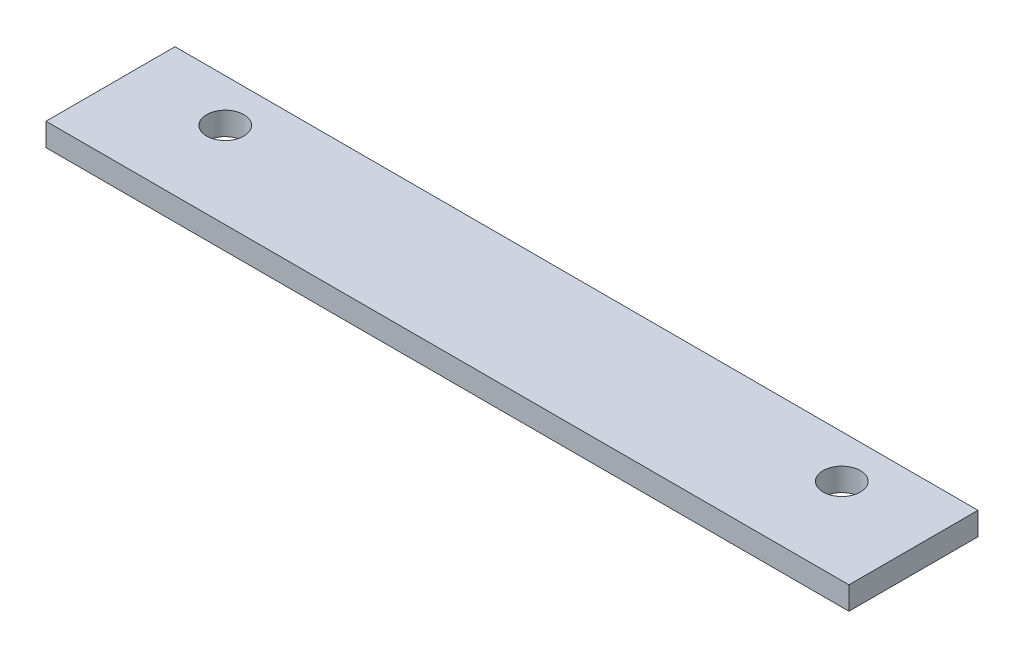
from build123d import *

# Parameters (mm, degrees)
SKETCH1_W           = 560
SKETCH1_H           = 90
SKETCH1_R           = 13
BOSS_EXTRUDE1_DEPTH = 16


with BuildPart() as part:
    # Sketch1 → Boss-Extrude1 (new body)
    with BuildSketch(Plane(origin=(0, 0, 0), x_dir=(1, 0, 0), z_dir=(0, 1, 0))):
        Rectangle(SKETCH1_W, SKETCH1_H)
        with Locations(Location((215, 15, 0), (0, 0, 270))):
            Circle(SKETCH1_R, mode=Mode.SUBTRACT)
        with Locations(Location((-215, 15, 0), (0, 0, 90))):
            Circle(SKETCH1_R, mode=Mode.SUBTRACT)
    extrude(amount=BOSS_EXTRUDE1_DEPTH)


solid = part.part
